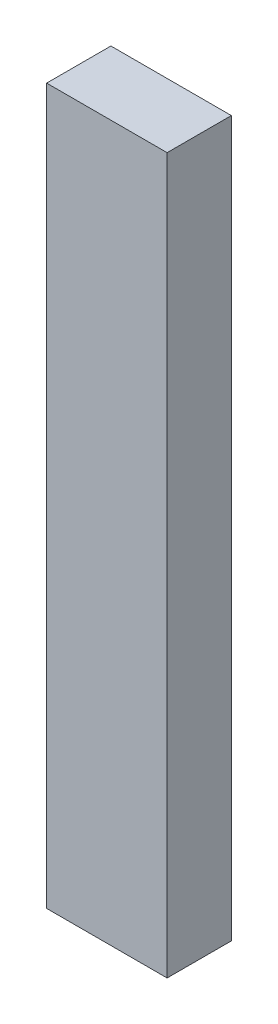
from build123d import *

# Parameters (mm, degrees)
ESQUISSE1_W      = 15
ESQUISSE1_H      = 89
EXTRUSION1_DEPTH = 8


with BuildPart() as part:
    # Esquisse1 → Extrusion1 (new body)
    with BuildSketch(Plane.XY):
        with Locations((7.5, 44.5)):
            Rectangle(ESQUISSE1_W, ESQUISSE1_H)
    extrude(amount=EXTRUSION1_DEPTH)


solid = part.part
